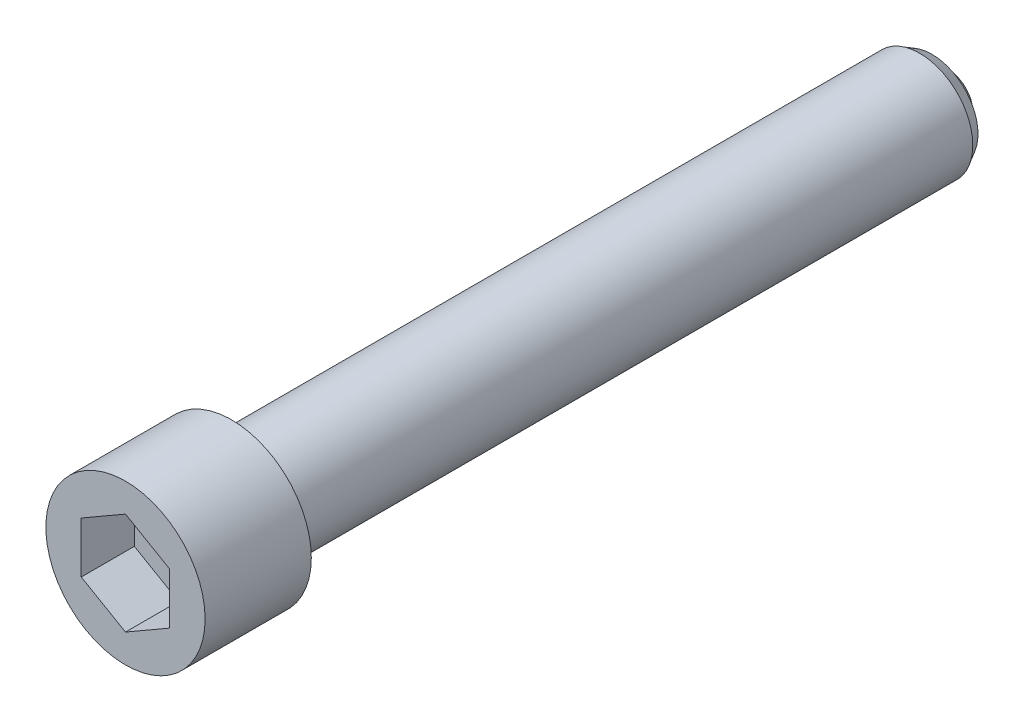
ISO-10303-21;
HEADER;
FILE_DESCRIPTION(('STEP AP214'),'2;1');
FILE_NAME('part.step','',(''),(''),'','','');
FILE_SCHEMA(('AUTOMOTIVE_DESIGN { 1 0 10303 214 1 1 1 1 }'));
ENDSEC;
DATA;
#1=APPLICATION_CONTEXT('core data for automotive mechanical design processes');
#2=APPLICATION_PROTOCOL_DEFINITION('international standard','automotive_design',2000,#1);
#3=PRODUCT_CONTEXT('',#1,'mechanical');
#4=PRODUCT('Part','Part','',(#3));
#5=PRODUCT_RELATED_PRODUCT_CATEGORY('part','',(#4));
#6=PRODUCT_DEFINITION_FORMATION('','',#4);
#7=PRODUCT_DEFINITION_CONTEXT('part definition',#1,'design');
#8=PRODUCT_DEFINITION('design','',#6,#7);
#9=PRODUCT_DEFINITION_SHAPE('','',#8);
#10=(LENGTH_UNIT() NAMED_UNIT(*) SI_UNIT(.MILLI.,.METRE.));
#11=(NAMED_UNIT(*) PLANE_ANGLE_UNIT() SI_UNIT($,.RADIAN.));
#12=(NAMED_UNIT(*) SI_UNIT($,.STERADIAN.) SOLID_ANGLE_UNIT());
#13=UNCERTAINTY_MEASURE_WITH_UNIT(LENGTH_MEASURE(1.E-05),#10,'distance_accuracy_value','');
#14=(GEOMETRIC_REPRESENTATION_CONTEXT(3) GLOBAL_UNCERTAINTY_ASSIGNED_CONTEXT((#13)) GLOBAL_UNIT_ASSIGNED_CONTEXT((#10,
#11,#12)) REPRESENTATION_CONTEXT('',''));
#15=CARTESIAN_POINT('',(0.,0.,0.));
#16=DIRECTION('',(0.,0.,1.));
#17=DIRECTION('',(1.,0.,0.));
#18=AXIS2_PLACEMENT_3D('',#15,#16,#17);
#19=CARTESIAN_POINT('',(0.,0.,4.35));
#20=DIRECTION('',(0.,0.,-1.));
#21=DIRECTION('',(1.,0.,0.));
#22=AXIS2_PLACEMENT_3D('',#19,#20,#21);
#23=SPHERICAL_SURFACE('',#22,4.35);
#24=CARTESIAN_POINT('',(0.,0.,2.85));
#25=DIRECTION('',(0.,0.,-1.));
#26=DIRECTION('',(1.,0.,0.));
#27=AXIS2_PLACEMENT_3D('',#24,#25,#26);
#28=CIRCLE('',#27,4.08319727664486);
#29=CARTESIAN_POINT('',(4.08319727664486,0.,2.85));
#30=VERTEX_POINT('',#29);
#31=EDGE_CURVE('E9',#30,#30,#28,.T.);
#32=ORIENTED_EDGE('',*,*,#31,.T.);
#33=EDGE_LOOP('',(#32));
#34=FACE_BOUND('',#33,.T.);
#35=ADVANCED_FACE('F15',(#34),#23,.T.);
#36=CARTESIAN_POINT('',(5.19170962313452,0.,2.85));
#37=DIRECTION('',(0.,0.,1.));
#38=DIRECTION('',(-1.,0.,0.));
#39=AXIS2_PLACEMENT_3D('',#36,#37,#38);
#40=PLANE('',#39);
#41=ORIENTED_EDGE('',*,*,#31,.F.);
#42=EDGE_LOOP('',(#41));
#43=FACE_BOUND('',#42,.T.);
#44=CARTESIAN_POINT('',(0.,0.,2.85));
#45=DIRECTION('',(0.,0.,-1.));
#46=DIRECTION('',(1.,0.,0.));
#47=AXIS2_PLACEMENT_3D('',#44,#45,#46);
#48=CIRCLE('',#47,5.19170962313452);
#49=CARTESIAN_POINT('',(5.19170962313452,0.,2.85));
#50=VERTEX_POINT('',#49);
#51=EDGE_CURVE('E22',#50,#50,#48,.T.);
#52=ORIENTED_EDGE('',*,*,#51,.T.);
#53=EDGE_LOOP('',(#52));
#54=FACE_BOUND('',#53,.T.);
#55=ADVANCED_FACE('F136',(#43,#54),#40,.F.);
#56=CARTESIAN_POINT('',(0.,0.,4.25));
#57=DIRECTION('',(0.,0.,1.));
#58=DIRECTION('',(-1.,0.,0.));
#59=AXIS2_PLACEMENT_3D('',#56,#57,#58);
#60=CONICAL_SURFACE('',#59,6.,0.523598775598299);
#61=ORIENTED_EDGE('',*,*,#51,.F.);
#62=EDGE_LOOP('',(#61));
#63=FACE_BOUND('',#62,.T.);
#64=CARTESIAN_POINT('',(0.,0.,4.25));
#65=DIRECTION('',(0.,0.,-1.));
#66=DIRECTION('',(1.,0.,0.));
#67=AXIS2_PLACEMENT_3D('',#64,#65,#66);
#68=CIRCLE('',#67,6.);
#69=CARTESIAN_POINT('',(6.,0.,4.25));
#70=VERTEX_POINT('',#69);
#71=EDGE_CURVE('E131',#70,#70,#68,.T.);
#72=ORIENTED_EDGE('',*,*,#71,.T.);
#73=EDGE_LOOP('',(#72));
#74=FACE_BOUND('',#73,.T.);
#75=ADVANCED_FACE('F138',(#63,#74),#60,.T.);
#76=CARTESIAN_POINT('',(0.,0.,-8.));
#77=DIRECTION('',(0.,0.,-1.));
#78=DIRECTION('',(1.,0.,0.));
#79=AXIS2_PLACEMENT_3D('',#76,#77,#78);
#80=CYLINDRICAL_SURFACE('',#79,6.);
#81=CARTESIAN_POINT('',(0.,0.,82.));
#82=DIRECTION('',(0.,0.,-1.));
#83=DIRECTION('',(1.,0.,0.));
#84=AXIS2_PLACEMENT_3D('',#81,#82,#83);
#85=CIRCLE('',#84,6.);
#86=CARTESIAN_POINT('',(6.,0.,82.));
#87=VERTEX_POINT('',#86);
#88=EDGE_CURVE('E128',#87,#87,#85,.T.);
#89=ORIENTED_EDGE('',*,*,#88,.T.);
#90=EDGE_LOOP('',(#89));
#91=FACE_BOUND('',#90,.T.);
#92=ORIENTED_EDGE('',*,*,#71,.F.);
#93=EDGE_LOOP('',(#92));
#94=FACE_BOUND('',#93,.T.);
#95=ADVANCED_FACE('F141',(#91,#94),#80,.T.);
#96=CARTESIAN_POINT('',(6.,0.,82.));
#97=DIRECTION('',(0.,0.,-1.));
#98=DIRECTION('',(1.,0.,0.));
#99=AXIS2_PLACEMENT_3D('',#96,#97,#98);
#100=PLANE('',#99);
#101=CARTESIAN_POINT('',(0.,0.,82.));
#102=DIRECTION('',(0.,0.,-1.));
#103=DIRECTION('',(1.,0.,0.));
#104=AXIS2_PLACEMENT_3D('',#101,#102,#103);
#105=CIRCLE('',#104,9.);
#106=CARTESIAN_POINT('',(9.,0.,82.));
#107=VERTEX_POINT('',#106);
#108=EDGE_CURVE('E125',#107,#107,#105,.T.);
#109=ORIENTED_EDGE('',*,*,#108,.T.);
#110=EDGE_LOOP('',(#109));
#111=FACE_BOUND('',#110,.T.);
#112=ORIENTED_EDGE('',*,*,#88,.F.);
#113=EDGE_LOOP('',(#112));
#114=FACE_BOUND('',#113,.T.);
#115=ADVANCED_FACE('F146',(#111,#114),#100,.T.);
#116=CARTESIAN_POINT('',(0.,0.,-8.));
#117=DIRECTION('',(0.,0.,-1.));
#118=DIRECTION('',(1.,0.,0.));
#119=AXIS2_PLACEMENT_3D('',#116,#117,#118);
#120=CYLINDRICAL_SURFACE('',#119,9.);
#121=CARTESIAN_POINT('',(0.,0.,94.));
#122=DIRECTION('',(0.,0.,-1.));
#123=DIRECTION('',(1.,0.,0.));
#124=AXIS2_PLACEMENT_3D('',#121,#122,#123);
#125=CIRCLE('',#124,9.);
#126=CARTESIAN_POINT('',(9.,0.,94.));
#127=VERTEX_POINT('',#126);
#128=EDGE_CURVE('E122',#127,#127,#125,.T.);
#129=ORIENTED_EDGE('',*,*,#128,.T.);
#130=EDGE_LOOP('',(#129));
#131=FACE_BOUND('',#130,.T.);
#132=ORIENTED_EDGE('',*,*,#108,.F.);
#133=EDGE_LOOP('',(#132));
#134=FACE_BOUND('',#133,.T.);
#135=ADVANCED_FACE('F153',(#131,#134),#120,.T.);
#136=CARTESIAN_POINT('',(9.,0.,94.));
#137=DIRECTION('',(0.,0.,1.));
#138=DIRECTION('',(-1.,0.,0.));
#139=AXIS2_PLACEMENT_3D('',#136,#137,#138);
#140=PLANE('',#139);
#141=DIRECTION('',(-0.86602540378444,0.5,0.));
#142=VECTOR('',#141,1.);
#143=CARTESIAN_POINT('',(5.,2.88675134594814,94.));
#144=LINE('',#143,#142);
#145=CARTESIAN_POINT('',(5.,2.88675134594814,94.));
#146=VERTEX_POINT('',#145);
#147=CARTESIAN_POINT('',(0.,5.77350269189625,94.));
#148=VERTEX_POINT('',#147);
#149=EDGE_CURVE('E29',#146,#148,#144,.T.);
#150=ORIENTED_EDGE('',*,*,#149,.F.);
#151=DIRECTION('',(0.,1.,0.));
#152=VECTOR('',#151,1.);
#153=CARTESIAN_POINT('',(5.,-2.88675134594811,94.));
#154=LINE('',#153,#152);
#155=CARTESIAN_POINT('',(5.,-2.88675134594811,94.));
#156=VERTEX_POINT('',#155);
#157=EDGE_CURVE('E98',#156,#146,#154,.T.);
#158=ORIENTED_EDGE('',*,*,#157,.F.);
#159=DIRECTION('',(-0.866025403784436,-0.5,0.));
#160=VECTOR('',#159,1.);
#161=CARTESIAN_POINT('',(5.,-2.88675134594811,94.));
#162=LINE('',#161,#160);
#163=CARTESIAN_POINT('',(0.,-5.77350269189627,94.));
#164=VERTEX_POINT('',#163);
#165=EDGE_CURVE('E93',#156,#164,#162,.T.);
#166=ORIENTED_EDGE('',*,*,#165,.T.);
#167=DIRECTION('',(0.866025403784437,-0.5,0.));
#168=VECTOR('',#167,1.);
#169=CARTESIAN_POINT('',(-5.,-2.88675134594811,94.));
#170=LINE('',#169,#168);
#171=CARTESIAN_POINT('',(-5.,-2.88675134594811,94.));
#172=VERTEX_POINT('',#171);
#173=EDGE_CURVE('E91',#172,#164,#170,.T.);
#174=ORIENTED_EDGE('',*,*,#173,.F.);
#175=DIRECTION('',(0.,1.,0.));
#176=VECTOR('',#175,1.);
#177=CARTESIAN_POINT('',(-5.,-2.88675134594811,94.));
#178=LINE('',#177,#176);
#179=CARTESIAN_POINT('',(-5.,2.88675134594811,94.));
#180=VERTEX_POINT('',#179);
#181=EDGE_CURVE('E72',#172,#180,#178,.T.);
#182=ORIENTED_EDGE('',*,*,#181,.T.);
#183=DIRECTION('',(0.866025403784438,0.5,0.));
#184=VECTOR('',#183,1.);
#185=CARTESIAN_POINT('',(-5.,2.88675134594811,94.));
#186=LINE('',#185,#184);
#187=EDGE_CURVE('E83',#180,#148,#186,.T.);
#188=ORIENTED_EDGE('',*,*,#187,.T.);
#189=EDGE_LOOP('',(#150,#158,#166,#174,#182,#188));
#190=FACE_BOUND('',#189,.T.);
#191=ORIENTED_EDGE('',*,*,#128,.F.);
#192=EDGE_LOOP('',(#191));
#193=FACE_BOUND('',#192,.T.);
#194=ADVANCED_FACE('F87',(#190,#193),#140,.T.);
#195=CARTESIAN_POINT('',(5.,2.88675134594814,88.));
#196=DIRECTION('',(0.5,0.86602540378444,0.));
#197=DIRECTION('',(0.86602540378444,-0.5,0.));
#198=AXIS2_PLACEMENT_3D('',#195,#196,#197);
#199=PLANE('',#198);
#200=DIRECTION('',(0.,0.,1.));
#201=VECTOR('',#200,1.);
#202=CARTESIAN_POINT('',(5.,2.88675134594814,88.));
#203=LINE('',#202,#201);
#204=CARTESIAN_POINT('',(5.,2.88675134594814,88.));
#205=VERTEX_POINT('',#204);
#206=EDGE_CURVE('E36',#205,#146,#203,.T.);
#207=ORIENTED_EDGE('',*,*,#206,.T.);
#208=ORIENTED_EDGE('',*,*,#149,.T.);
#209=DIRECTION('',(0.,0.,1.));
#210=VECTOR('',#209,1.);
#211=CARTESIAN_POINT('',(0.,5.77350269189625,88.));
#212=LINE('',#211,#210);
#213=CARTESIAN_POINT('',(0.,5.77350269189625,88.));
#214=VERTEX_POINT('',#213);
#215=EDGE_CURVE('E80',#214,#148,#212,.T.);
#216=ORIENTED_EDGE('',*,*,#215,.F.);
#217=DIRECTION('',(-0.86602540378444,0.5,0.));
#218=VECTOR('',#217,1.);
#219=CARTESIAN_POINT('',(5.,2.88675134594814,88.));
#220=LINE('',#219,#218);
#221=EDGE_CURVE('E100',#205,#214,#220,.T.);
#222=ORIENTED_EDGE('',*,*,#221,.F.);
#223=EDGE_LOOP('',(#207,#208,#216,#222));
#224=FACE_BOUND('',#223,.T.);
#225=ADVANCED_FACE('F205',(#224),#199,.F.);
#226=CARTESIAN_POINT('',(5.,-2.88675134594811,88.));
#227=DIRECTION('',(1.,0.,0.));
#228=DIRECTION('',(0.,-1.,0.));
#229=AXIS2_PLACEMENT_3D('',#226,#227,#228);
#230=PLANE('',#229);
#231=DIRECTION('',(0.,0.,1.));
#232=VECTOR('',#231,1.);
#233=CARTESIAN_POINT('',(5.,-2.88675134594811,88.));
#234=LINE('',#233,#232);
#235=CARTESIAN_POINT('',(5.,-2.88675134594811,88.));
#236=VERTEX_POINT('',#235);
#237=EDGE_CURVE('E119',#236,#156,#234,.T.);
#238=ORIENTED_EDGE('',*,*,#237,.T.);
#239=ORIENTED_EDGE('',*,*,#157,.T.);
#240=ORIENTED_EDGE('',*,*,#206,.F.);
#241=DIRECTION('',(0.,1.,0.));
#242=VECTOR('',#241,1.);
#243=CARTESIAN_POINT('',(5.,-2.88675134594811,88.));
#244=LINE('',#243,#242);
#245=EDGE_CURVE('E112',#236,#205,#244,.T.);
#246=ORIENTED_EDGE('',*,*,#245,.F.);
#247=EDGE_LOOP('',(#238,#239,#240,#246));
#248=FACE_BOUND('',#247,.T.);
#249=ADVANCED_FACE('F214',(#248),#230,.F.);
#250=CARTESIAN_POINT('',(5.,-2.88675134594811,88.));
#251=DIRECTION('',(-0.5,0.866025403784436,0.));
#252=DIRECTION('',(0.866025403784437,0.5,0.));
#253=AXIS2_PLACEMENT_3D('',#250,#251,#252);
#254=PLANE('',#253);
#255=DIRECTION('',(0.,0.,1.));
#256=VECTOR('',#255,1.);
#257=CARTESIAN_POINT('',(0.,-5.77350269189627,88.));
#258=LINE('',#257,#256);
#259=CARTESIAN_POINT('',(0.,-5.77350269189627,88.));
#260=VERTEX_POINT('',#259);
#261=EDGE_CURVE('E117',#260,#164,#258,.T.);
#262=ORIENTED_EDGE('',*,*,#261,.T.);
#263=ORIENTED_EDGE('',*,*,#165,.F.);
#264=ORIENTED_EDGE('',*,*,#237,.F.);
#265=DIRECTION('',(-0.866025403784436,-0.5,0.));
#266=VECTOR('',#265,1.);
#267=CARTESIAN_POINT('',(5.,-2.88675134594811,88.));
#268=LINE('',#267,#266);
#269=EDGE_CURVE('E109',#236,#260,#268,.T.);
#270=ORIENTED_EDGE('',*,*,#269,.T.);
#271=EDGE_LOOP('',(#262,#263,#264,#270));
#272=FACE_BOUND('',#271,.T.);
#273=ADVANCED_FACE('F223',(#272),#254,.T.);
#274=CARTESIAN_POINT('',(-5.,-2.88675134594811,88.));
#275=DIRECTION('',(-0.5,-0.866025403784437,0.));
#276=DIRECTION('',(-0.866025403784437,0.5,0.));
#277=AXIS2_PLACEMENT_3D('',#274,#275,#276);
#278=PLANE('',#277);
#279=DIRECTION('',(0.,0.,1.));
#280=VECTOR('',#279,1.);
#281=CARTESIAN_POINT('',(-5.,-2.88675134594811,88.));
#282=LINE('',#281,#280);
#283=CARTESIAN_POINT('',(-5.,-2.88675134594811,88.));
#284=VERTEX_POINT('',#283);
#285=EDGE_CURVE('E79',#284,#172,#282,.T.);
#286=ORIENTED_EDGE('',*,*,#285,.T.);
#287=ORIENTED_EDGE('',*,*,#173,.T.);
#288=ORIENTED_EDGE('',*,*,#261,.F.);
#289=DIRECTION('',(0.866025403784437,-0.5,0.));
#290=VECTOR('',#289,1.);
#291=CARTESIAN_POINT('',(-5.,-2.88675134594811,88.));
#292=LINE('',#291,#290);
#293=EDGE_CURVE('E106',#284,#260,#292,.T.);
#294=ORIENTED_EDGE('',*,*,#293,.F.);
#295=EDGE_LOOP('',(#286,#287,#288,#294));
#296=FACE_BOUND('',#295,.T.);
#297=ADVANCED_FACE('F232',(#296),#278,.F.);
#298=CARTESIAN_POINT('',(-5.,-2.88675134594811,88.));
#299=DIRECTION('',(1.,0.,0.));
#300=DIRECTION('',(0.,-1.,0.));
#301=AXIS2_PLACEMENT_3D('',#298,#299,#300);
#302=PLANE('',#301);
#303=DIRECTION('',(0.,0.,1.));
#304=VECTOR('',#303,1.);
#305=CARTESIAN_POINT('',(-5.,2.88675134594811,88.));
#306=LINE('',#305,#304);
#307=CARTESIAN_POINT('',(-5.,2.88675134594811,88.));
#308=VERTEX_POINT('',#307);
#309=EDGE_CURVE('E68',#308,#180,#306,.T.);
#310=ORIENTED_EDGE('',*,*,#309,.T.);
#311=ORIENTED_EDGE('',*,*,#181,.F.);
#312=ORIENTED_EDGE('',*,*,#285,.F.);
#313=DIRECTION('',(0.,1.,0.));
#314=VECTOR('',#313,1.);
#315=CARTESIAN_POINT('',(-5.,-2.88675134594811,88.));
#316=LINE('',#315,#314);
#317=EDGE_CURVE('E75',#284,#308,#316,.T.);
#318=ORIENTED_EDGE('',*,*,#317,.T.);
#319=EDGE_LOOP('',(#310,#311,#312,#318));
#320=FACE_BOUND('',#319,.T.);
#321=ADVANCED_FACE('F70',(#320),#302,.T.);
#322=CARTESIAN_POINT('',(-5.,2.88675134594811,88.));
#323=DIRECTION('',(0.5,-0.866025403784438,0.));
#324=DIRECTION('',(-0.866025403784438,-0.5,0.));
#325=AXIS2_PLACEMENT_3D('',#322,#323,#324);
#326=PLANE('',#325);
#327=DIRECTION('',(0.866025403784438,0.5,0.));
#328=VECTOR('',#327,1.);
#329=CARTESIAN_POINT('',(-5.,2.88675134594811,88.));
#330=LINE('',#329,#328);
#331=EDGE_CURVE('E103',#308,#214,#330,.T.);
#332=ORIENTED_EDGE('',*,*,#331,.T.);
#333=ORIENTED_EDGE('',*,*,#215,.T.);
#334=ORIENTED_EDGE('',*,*,#187,.F.);
#335=ORIENTED_EDGE('',*,*,#309,.F.);
#336=EDGE_LOOP('',(#332,#333,#334,#335));
#337=FACE_BOUND('',#336,.T.);
#338=ADVANCED_FACE('F84',(#337),#326,.T.);
#339=CARTESIAN_POINT('',(-5.,8.66025403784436,88.));
#340=DIRECTION('',(0.,0.,-1.));
#341=DIRECTION('',(1.,0.,0.));
#342=AXIS2_PLACEMENT_3D('',#339,#340,#341);
#343=PLANE('',#342);
#344=ORIENTED_EDGE('',*,*,#221,.T.);
#345=ORIENTED_EDGE('',*,*,#331,.F.);
#346=ORIENTED_EDGE('',*,*,#317,.F.);
#347=ORIENTED_EDGE('',*,*,#293,.T.);
#348=ORIENTED_EDGE('',*,*,#269,.F.);
#349=ORIENTED_EDGE('',*,*,#245,.T.);
#350=EDGE_LOOP('',(#344,#345,#346,#347,#348,#349));
#351=FACE_BOUND('',#350,.T.);
#352=ADVANCED_FACE('F252',(#351),#343,.F.);
#353=CLOSED_SHELL('',(#35,#55,#75,#95,#115,#135,#194,#225,#249,#273,#297,#321,#338,#352));
#354=MANIFOLD_SOLID_BREP('B1',#353);
#355=ADVANCED_BREP_SHAPE_REPRESENTATION('',(#18,#354),#14);
#356=SHAPE_DEFINITION_REPRESENTATION(#9,#355);
ENDSEC;
END-ISO-10303-21;
